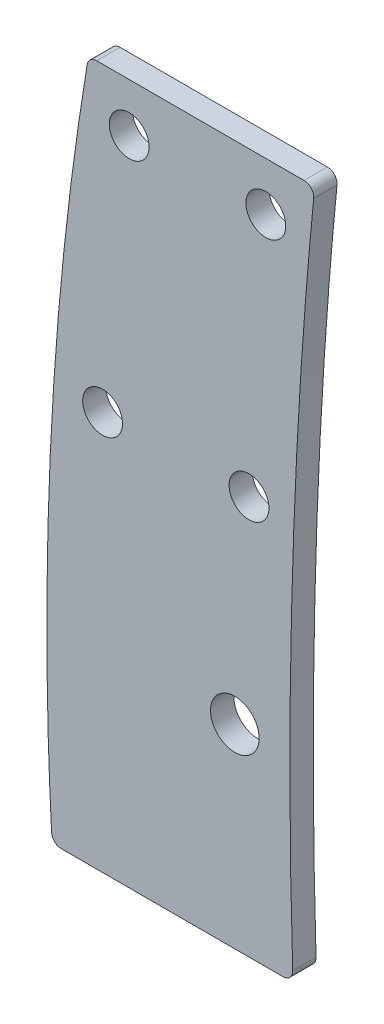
ISO-10303-21;
HEADER;
FILE_DESCRIPTION(('STEP AP214'),'2;1');
FILE_NAME('part.step','',(''),(''),'','','');
FILE_SCHEMA(('AUTOMOTIVE_DESIGN { 1 0 10303 214 1 1 1 1 }'));
ENDSEC;
DATA;
#1=APPLICATION_CONTEXT('core data for automotive mechanical design processes');
#2=APPLICATION_PROTOCOL_DEFINITION('international standard','automotive_design',2000,#1);
#3=PRODUCT_CONTEXT('',#1,'mechanical');
#4=PRODUCT('Part','Part','',(#3));
#5=PRODUCT_RELATED_PRODUCT_CATEGORY('part','',(#4));
#6=PRODUCT_DEFINITION_FORMATION('','',#4);
#7=PRODUCT_DEFINITION_CONTEXT('part definition',#1,'design');
#8=PRODUCT_DEFINITION('design','',#6,#7);
#9=PRODUCT_DEFINITION_SHAPE('','',#8);
#10=(LENGTH_UNIT() NAMED_UNIT(*) SI_UNIT(.MILLI.,.METRE.));
#11=(NAMED_UNIT(*) PLANE_ANGLE_UNIT() SI_UNIT($,.RADIAN.));
#12=(NAMED_UNIT(*) SI_UNIT($,.STERADIAN.) SOLID_ANGLE_UNIT());
#13=UNCERTAINTY_MEASURE_WITH_UNIT(LENGTH_MEASURE(1.E-05),#10,'distance_accuracy_value','');
#14=(GEOMETRIC_REPRESENTATION_CONTEXT(3) GLOBAL_UNCERTAINTY_ASSIGNED_CONTEXT((#13)) GLOBAL_UNIT_ASSIGNED_CONTEXT((#10,
#11,#12)) REPRESENTATION_CONTEXT('',''));
#15=CARTESIAN_POINT('',(0.,0.,0.));
#16=DIRECTION('',(0.,0.,1.));
#17=DIRECTION('',(1.,0.,0.));
#18=AXIS2_PLACEMENT_3D('',#15,#16,#17);
#19=CARTESIAN_POINT('',(-14.239497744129,-121.423692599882,2.3));
#20=DIRECTION('',(0.,0.,1.));
#21=DIRECTION('',(0.,1.,0.));
#22=AXIS2_PLACEMENT_3D('',#19,#20,#21);
#23=ELLIPSE('',#22,130.446604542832,50.);
#24=DIRECTION('',(0.,0.,-1.));
#25=VECTOR('',#24,1.);
#26=SURFACE_OF_LINEAR_EXTRUSION('',#23,#25);
#27=CARTESIAN_POINT('',(-14.239497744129,-121.423692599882,0.));
#28=DIRECTION('',(0.,0.,1.));
#29=DIRECTION('',(0.,1.,0.));
#30=AXIS2_PLACEMENT_3D('',#27,#28,#29);
#31=ELLIPSE('',#30,130.446604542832,50.);
#32=CARTESIAN_POINT('',(-60.089402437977,-69.3896398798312,0.));
#33=VERTEX_POINT('',#32);
#34=CARTESIAN_POINT('',(-63.7513035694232,-139.607983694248,0.));
#35=VERTEX_POINT('',#34);
#36=EDGE_CURVE('E104',#33,#35,#31,.T.);
#37=ORIENTED_EDGE('',*,*,#36,.T.);
#38=DIRECTION('',(0.,0.,-1.));
#39=VECTOR('',#38,1.);
#40=CARTESIAN_POINT('',(-63.7513035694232,-139.607983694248,0.));
#41=LINE('',#40,#39);
#42=CARTESIAN_POINT('',(-63.7513035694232,-139.607983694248,2.4));
#43=VERTEX_POINT('',#42);
#44=EDGE_CURVE('E99',#35,#43,#41,.F.);
#45=ORIENTED_EDGE('',*,*,#44,.T.);
#46=CARTESIAN_POINT('',(-14.239497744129,-121.423692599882,2.4));
#47=DIRECTION('',(0.,0.,1.));
#48=DIRECTION('',(0.,1.,0.));
#49=AXIS2_PLACEMENT_3D('',#46,#47,#48);
#50=ELLIPSE('',#49,130.446604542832,50.);
#51=CARTESIAN_POINT('',(-60.089402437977,-69.3896398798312,2.4));
#52=VERTEX_POINT('',#51);
#53=EDGE_CURVE('E102',#52,#43,#50,.T.);
#54=ORIENTED_EDGE('',*,*,#53,.F.);
#55=DIRECTION('',(0.,0.,-1.));
#56=VECTOR('',#55,1.);
#57=CARTESIAN_POINT('',(-60.089402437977,-69.3896398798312,2.3));
#58=LINE('',#57,#56);
#59=EDGE_CURVE('E108',#52,#33,#58,.T.);
#60=ORIENTED_EDGE('',*,*,#59,.T.);
#61=EDGE_LOOP('',(#37,#45,#54,#60));
#62=FACE_BOUND('',#61,.T.);
#63=ADVANCED_FACE('F33',(#62),#26,.F.);
#64=CARTESIAN_POINT('',(-14.239497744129,-121.423692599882,2.3));
#65=DIRECTION('',(0.,0.,-1.));
#66=DIRECTION('',(0.,-1.,0.));
#67=AXIS2_PLACEMENT_3D('',#64,#65,#66);
#68=ELLIPSE('',#67,120.,25.);
#69=DIRECTION('',(0.,0.,-1.));
#70=VECTOR('',#69,1.);
#71=SURFACE_OF_LINEAR_EXTRUSION('',#68,#70);
#72=DIRECTION('',(0.,0.,-1.));
#73=VECTOR('',#72,1.);
#74=CARTESIAN_POINT('',(-36.7932724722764,-69.6532402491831,0.));
#75=LINE('',#74,#73);
#76=CARTESIAN_POINT('',(-36.7932724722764,-69.6532402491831,0.));
#77=VERTEX_POINT('',#76);
#78=CARTESIAN_POINT('',(-36.7932724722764,-69.653240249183,2.4));
#79=VERTEX_POINT('',#78);
#80=EDGE_CURVE('E180',#77,#79,#75,.F.);
#81=ORIENTED_EDGE('',*,*,#80,.T.);
#82=CARTESIAN_POINT('',(-14.239497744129,-121.423692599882,2.4));
#83=DIRECTION('',(0.,0.,-1.));
#84=DIRECTION('',(0.,-1.,0.));
#85=AXIS2_PLACEMENT_3D('',#82,#83,#84);
#86=ELLIPSE('',#85,120.,25.);
#87=CARTESIAN_POINT('',(-38.9535210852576,-139.522334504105,2.4));
#88=VERTEX_POINT('',#87);
#89=EDGE_CURVE('E135',#88,#79,#86,.T.);
#90=ORIENTED_EDGE('',*,*,#89,.F.);
#91=DIRECTION('',(0.,0.,-1.));
#92=VECTOR('',#91,1.);
#93=CARTESIAN_POINT('',(-38.9535210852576,-139.522334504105,2.3));
#94=LINE('',#93,#92);
#95=CARTESIAN_POINT('',(-38.9535210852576,-139.522334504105,0.));
#96=VERTEX_POINT('',#95);
#97=EDGE_CURVE('E55',#88,#96,#94,.T.);
#98=ORIENTED_EDGE('',*,*,#97,.T.);
#99=CARTESIAN_POINT('',(-14.239497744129,-121.423692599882,0.));
#100=DIRECTION('',(0.,0.,-1.));
#101=DIRECTION('',(0.,-1.,0.));
#102=AXIS2_PLACEMENT_3D('',#99,#100,#101);
#103=ELLIPSE('',#102,120.,25.);
#104=EDGE_CURVE('E191',#96,#77,#103,.T.);
#105=ORIENTED_EDGE('',*,*,#104,.T.);
#106=EDGE_LOOP('',(#81,#90,#98,#105));
#107=FACE_BOUND('',#106,.T.);
#108=ADVANCED_FACE('F153',(#107),#71,.F.);
#109=CARTESIAN_POINT('',(-14.239497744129,-121.423692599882,0.));
#110=DIRECTION('',(0.,0.,1.));
#111=DIRECTION('',(1.,0.,0.));
#112=AXIS2_PLACEMENT_3D('',#109,#110,#111);
#113=PLANE('',#112);
#114=CARTESIAN_POINT('',(-55.7704318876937,-73.5541033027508,0.));
#115=DIRECTION('',(0.,0.,1.));
#116=DIRECTION('',(1.,0.,0.));
#117=AXIS2_PLACEMENT_3D('',#114,#115,#116);
#118=CIRCLE('',#117,2.04999999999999);
#119=CARTESIAN_POINT('',(-53.7204318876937,-73.5541033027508,0.));
#120=VERTEX_POINT('',#119);
#121=EDGE_CURVE('E225',#120,#120,#118,.T.);
#122=ORIENTED_EDGE('',*,*,#121,.T.);
#123=EDGE_LOOP('',(#122));
#124=FACE_BOUND('',#123,.T.);
#125=CARTESIAN_POINT('',(-41.7189587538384,-73.5541033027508,0.));
#126=DIRECTION('',(0.,0.,1.));
#127=DIRECTION('',(1.,0.,0.));
#128=AXIS2_PLACEMENT_3D('',#125,#126,#127);
#129=CIRCLE('',#128,2.04999999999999);
#130=CARTESIAN_POINT('',(-39.6689587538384,-73.5541033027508,0.));
#131=VERTEX_POINT('',#130);
#132=EDGE_CURVE('E229',#131,#131,#129,.T.);
#133=ORIENTED_EDGE('',*,*,#132,.T.);
#134=EDGE_LOOP('',(#133));
#135=FACE_BOUND('',#134,.T.);
#136=CARTESIAN_POINT('',(-43.4487055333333,-99.5541033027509,0.));
#137=DIRECTION('',(0.,0.,1.));
#138=DIRECTION('',(1.,0.,0.));
#139=AXIS2_PLACEMENT_3D('',#136,#137,#138);
#140=CIRCLE('',#139,2.04999999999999);
#141=CARTESIAN_POINT('',(-41.3987055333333,-99.5541033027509,0.));
#142=VERTEX_POINT('',#141);
#143=EDGE_CURVE('E233',#142,#142,#140,.T.);
#144=ORIENTED_EDGE('',*,*,#143,.T.);
#145=EDGE_LOOP('',(#144));
#146=FACE_BOUND('',#145,.T.);
#147=CARTESIAN_POINT('',(-58.5038553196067,-99.5541033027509,0.));
#148=DIRECTION('',(0.,0.,1.));
#149=DIRECTION('',(1.,0.,0.));
#150=AXIS2_PLACEMENT_3D('',#147,#148,#149);
#151=CIRCLE('',#150,2.04999999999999);
#152=CARTESIAN_POINT('',(-56.4538553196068,-99.5541033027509,0.));
#153=VERTEX_POINT('',#152);
#154=EDGE_CURVE('E237',#153,#153,#151,.T.);
#155=ORIENTED_EDGE('',*,*,#154,.T.);
#156=EDGE_LOOP('',(#155));
#157=FACE_BOUND('',#156,.T.);
#158=CARTESIAN_POINT('',(-44.9054314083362,-120.554103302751,0.));
#159=DIRECTION('',(0.,0.,1.));
#160=DIRECTION('',(1.,0.,0.));
#161=AXIS2_PLACEMENT_3D('',#158,#159,#160);
#162=CIRCLE('',#161,2.49999999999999);
#163=CARTESIAN_POINT('',(-42.4054314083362,-120.554103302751,0.));
#164=VERTEX_POINT('',#163);
#165=EDGE_CURVE('E124',#164,#164,#162,.T.);
#166=ORIENTED_EDGE('',*,*,#165,.T.);
#167=EDGE_LOOP('',(#166));
#168=FACE_BOUND('',#167,.T.);
#169=DIRECTION('',(1.,0.,0.));
#170=VECTOR('',#169,1.);
#171=CARTESIAN_POINT('',(-63.6988962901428,-140.554103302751,0.));
#172=LINE('',#171,#170);
#173=CARTESIAN_POINT('',(-62.7527561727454,-140.554103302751,0.));
#174=VERTEX_POINT('',#173);
#175=CARTESIAN_POINT('',(-39.9530163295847,-140.554103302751,0.));
#176=VERTEX_POINT('',#175);
#177=EDGE_CURVE('E188',#174,#176,#172,.T.);
#178=ORIENTED_EDGE('',*,*,#177,.F.);
#179=CARTESIAN_POINT('',(-62.7527561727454,-139.554103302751,0.));
#180=DIRECTION('',(0.,0.,1.));
#181=DIRECTION('',(1.,0.,0.));
#182=AXIS2_PLACEMENT_3D('',#179,#180,#181);
#183=CIRCLE('',#182,1.);
#184=EDGE_CURVE('E174',#174,#35,#183,.F.);
#185=ORIENTED_EDGE('',*,*,#184,.T.);
#186=ORIENTED_EDGE('',*,*,#36,.F.);
#187=CARTESIAN_POINT('',(-59.103019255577,-69.5541033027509,0.));
#188=DIRECTION('',(0.,0.,1.));
#189=DIRECTION('',(1.,0.,0.));
#190=AXIS2_PLACEMENT_3D('',#187,#188,#189);
#191=CIRCLE('',#190,1.);
#192=CARTESIAN_POINT('',(-59.103019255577,-68.5541033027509,0.));
#193=VERTEX_POINT('',#192);
#194=EDGE_CURVE('E170',#33,#193,#191,.F.);
#195=ORIENTED_EDGE('',*,*,#194,.T.);
#196=DIRECTION('',(-1.,0.,0.));
#197=VECTOR('',#196,1.);
#198=CARTESIAN_POINT('',(-36.6823326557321,-68.5541033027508,0.));
#199=LINE('',#198,#197);
#200=CARTESIAN_POINT('',(-37.7883462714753,-68.5541033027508,0.));
#201=VERTEX_POINT('',#200);
#202=EDGE_CURVE('E144',#201,#193,#199,.T.);
#203=ORIENTED_EDGE('',*,*,#202,.F.);
#204=CARTESIAN_POINT('',(-37.7883462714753,-69.5541033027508,0.));
#205=DIRECTION('',(0.,0.,1.));
#206=DIRECTION('',(1.,0.,0.));
#207=AXIS2_PLACEMENT_3D('',#204,#205,#206);
#208=CIRCLE('',#207,1.);
#209=EDGE_CURVE('E48',#201,#77,#208,.F.);
#210=ORIENTED_EDGE('',*,*,#209,.T.);
#211=ORIENTED_EDGE('',*,*,#104,.F.);
#212=CARTESIAN_POINT('',(-39.9530163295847,-139.554103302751,0.));
#213=DIRECTION('',(0.,0.,1.));
#214=DIRECTION('',(1.,0.,0.));
#215=AXIS2_PLACEMENT_3D('',#212,#213,#214);
#216=CIRCLE('',#215,1.);
#217=EDGE_CURVE('E172',#96,#176,#216,.F.);
#218=ORIENTED_EDGE('',*,*,#217,.T.);
#219=EDGE_LOOP('',(#178,#185,#186,#195,#203,#210,#211,#218));
#220=FACE_BOUND('',#219,.T.);
#221=ADVANCED_FACE('F187',(#124,#135,#146,#157,#168,#220),#113,.F.);
#222=CARTESIAN_POINT('',(-36.6823326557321,-68.5541033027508,0.));
#223=DIRECTION('',(0.,1.,0.));
#224=DIRECTION('',(-1.,0.,0.));
#225=AXIS2_PLACEMENT_3D('',#222,#223,#224);
#226=PLANE('',#225);
#227=ORIENTED_EDGE('',*,*,#202,.T.);
#228=DIRECTION('',(0.,0.,1.));
#229=VECTOR('',#228,1.);
#230=CARTESIAN_POINT('',(-59.103019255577,-68.5541033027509,2.3));
#231=LINE('',#230,#229);
#232=CARTESIAN_POINT('',(-59.103019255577,-68.5541033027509,2.4));
#233=VERTEX_POINT('',#232);
#234=EDGE_CURVE('E12',#193,#233,#231,.T.);
#235=ORIENTED_EDGE('',*,*,#234,.T.);
#236=DIRECTION('',(-1.,0.,0.));
#237=VECTOR('',#236,1.);
#238=CARTESIAN_POINT('',(-37.7883462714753,-68.5541033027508,2.4));
#239=LINE('',#238,#237);
#240=CARTESIAN_POINT('',(-37.7883462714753,-68.5541033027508,2.4));
#241=VERTEX_POINT('',#240);
#242=EDGE_CURVE('E141',#241,#233,#239,.T.);
#243=ORIENTED_EDGE('',*,*,#242,.F.);
#244=DIRECTION('',(0.,0.,1.));
#245=VECTOR('',#244,1.);
#246=CARTESIAN_POINT('',(-37.7883462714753,-68.5541033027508,0.));
#247=LINE('',#246,#245);
#248=EDGE_CURVE('E41',#241,#201,#247,.F.);
#249=ORIENTED_EDGE('',*,*,#248,.T.);
#250=EDGE_LOOP('',(#227,#235,#243,#249));
#251=FACE_BOUND('',#250,.T.);
#252=ADVANCED_FACE('F184',(#251),#226,.T.);
#253=CARTESIAN_POINT('',(-63.6988962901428,-140.554103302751,0.));
#254=DIRECTION('',(0.,-1.,0.));
#255=DIRECTION('',(1.,0.,0.));
#256=AXIS2_PLACEMENT_3D('',#253,#254,#255);
#257=PLANE('',#256);
#258=DIRECTION('',(0.,0.,1.));
#259=VECTOR('',#258,1.);
#260=CARTESIAN_POINT('',(-39.9530163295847,-140.554103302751,2.3));
#261=LINE('',#260,#259);
#262=CARTESIAN_POINT('',(-39.9530163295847,-140.554103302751,2.4));
#263=VERTEX_POINT('',#262);
#264=EDGE_CURVE('E107',#176,#263,#261,.T.);
#265=ORIENTED_EDGE('',*,*,#264,.T.);
#266=DIRECTION('',(1.,0.,0.));
#267=VECTOR('',#266,1.);
#268=CARTESIAN_POINT('',(-62.7527561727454,-140.554103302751,2.4));
#269=LINE('',#268,#267);
#270=CARTESIAN_POINT('',(-62.7527561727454,-140.554103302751,2.4));
#271=VERTEX_POINT('',#270);
#272=EDGE_CURVE('E117',#271,#263,#269,.T.);
#273=ORIENTED_EDGE('',*,*,#272,.F.);
#274=DIRECTION('',(0.,0.,1.));
#275=VECTOR('',#274,1.);
#276=CARTESIAN_POINT('',(-62.7527561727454,-140.554103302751,0.));
#277=LINE('',#276,#275);
#278=EDGE_CURVE('E113',#271,#174,#277,.F.);
#279=ORIENTED_EDGE('',*,*,#278,.T.);
#280=ORIENTED_EDGE('',*,*,#177,.T.);
#281=EDGE_LOOP('',(#265,#273,#279,#280));
#282=FACE_BOUND('',#281,.T.);
#283=ADVANCED_FACE('F158',(#282),#257,.T.);
#284=CARTESIAN_POINT('',(-62.7527561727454,-139.554103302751,1.15));
#285=DIRECTION('',(0.,0.,-1.));
#286=DIRECTION('',(-1.,0.,0.));
#287=AXIS2_PLACEMENT_3D('',#284,#285,#286);
#288=CYLINDRICAL_SURFACE('',#287,1.);
#289=ORIENTED_EDGE('',*,*,#184,.F.);
#290=ORIENTED_EDGE('',*,*,#278,.F.);
#291=CARTESIAN_POINT('',(-62.7527561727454,-139.554103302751,2.4));
#292=DIRECTION('',(0.,0.,1.));
#293=DIRECTION('',(1.,0.,0.));
#294=AXIS2_PLACEMENT_3D('',#291,#292,#293);
#295=CIRCLE('',#294,1.);
#296=EDGE_CURVE('E111',#43,#271,#295,.T.);
#297=ORIENTED_EDGE('',*,*,#296,.F.);
#298=ORIENTED_EDGE('',*,*,#44,.F.);
#299=EDGE_LOOP('',(#289,#290,#297,#298));
#300=FACE_BOUND('',#299,.T.);
#301=ADVANCED_FACE('F112',(#300),#288,.T.);
#302=CARTESIAN_POINT('',(-39.9530163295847,-139.554103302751,1.15));
#303=DIRECTION('',(0.,0.,-1.));
#304=DIRECTION('',(-1.,0.,0.));
#305=AXIS2_PLACEMENT_3D('',#302,#303,#304);
#306=CYLINDRICAL_SURFACE('',#305,1.);
#307=ORIENTED_EDGE('',*,*,#217,.F.);
#308=ORIENTED_EDGE('',*,*,#97,.F.);
#309=CARTESIAN_POINT('',(-39.9530163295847,-139.554103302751,2.4));
#310=DIRECTION('',(0.,0.,1.));
#311=DIRECTION('',(1.,0.,0.));
#312=AXIS2_PLACEMENT_3D('',#309,#310,#311);
#313=CIRCLE('',#312,1.);
#314=EDGE_CURVE('E132',#263,#88,#313,.T.);
#315=ORIENTED_EDGE('',*,*,#314,.F.);
#316=ORIENTED_EDGE('',*,*,#264,.F.);
#317=EDGE_LOOP('',(#307,#308,#315,#316));
#318=FACE_BOUND('',#317,.T.);
#319=ADVANCED_FACE('F157',(#318),#306,.T.);
#320=CARTESIAN_POINT('',(-59.103019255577,-69.5541033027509,1.15));
#321=DIRECTION('',(0.,0.,-1.));
#322=DIRECTION('',(-1.,0.,0.));
#323=AXIS2_PLACEMENT_3D('',#320,#321,#322);
#324=CYLINDRICAL_SURFACE('',#323,1.);
#325=ORIENTED_EDGE('',*,*,#194,.F.);
#326=ORIENTED_EDGE('',*,*,#59,.F.);
#327=CARTESIAN_POINT('',(-59.103019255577,-69.5541033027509,2.4));
#328=DIRECTION('',(0.,0.,1.));
#329=DIRECTION('',(1.,0.,0.));
#330=AXIS2_PLACEMENT_3D('',#327,#328,#329);
#331=CIRCLE('',#330,1.);
#332=EDGE_CURVE('E123',#233,#52,#331,.T.);
#333=ORIENTED_EDGE('',*,*,#332,.F.);
#334=ORIENTED_EDGE('',*,*,#234,.F.);
#335=EDGE_LOOP('',(#325,#326,#333,#334));
#336=FACE_BOUND('',#335,.T.);
#337=ADVANCED_FACE('F160',(#336),#324,.T.);
#338=CARTESIAN_POINT('',(-37.7883462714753,-69.5541033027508,1.15));
#339=DIRECTION('',(0.,0.,-1.));
#340=DIRECTION('',(-1.,0.,0.));
#341=AXIS2_PLACEMENT_3D('',#338,#339,#340);
#342=CYLINDRICAL_SURFACE('',#341,1.);
#343=ORIENTED_EDGE('',*,*,#209,.F.);
#344=ORIENTED_EDGE('',*,*,#248,.F.);
#345=CARTESIAN_POINT('',(-37.7883462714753,-69.5541033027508,2.4));
#346=DIRECTION('',(0.,0.,1.));
#347=DIRECTION('',(1.,0.,0.));
#348=AXIS2_PLACEMENT_3D('',#345,#346,#347);
#349=CIRCLE('',#348,1.);
#350=EDGE_CURVE('E138',#79,#241,#349,.T.);
#351=ORIENTED_EDGE('',*,*,#350,.F.);
#352=ORIENTED_EDGE('',*,*,#80,.F.);
#353=EDGE_LOOP('',(#343,#344,#351,#352));
#354=FACE_BOUND('',#353,.T.);
#355=ADVANCED_FACE('F35',(#354),#342,.T.);
#356=CARTESIAN_POINT('',(-14.239497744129,-121.423692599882,2.4));
#357=DIRECTION('',(0.,0.,1.));
#358=DIRECTION('',(1.,0.,0.));
#359=AXIS2_PLACEMENT_3D('',#356,#357,#358);
#360=PLANE('',#359);
#361=CARTESIAN_POINT('',(-55.7704318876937,-73.5541033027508,2.4));
#362=DIRECTION('',(0.,0.,1.));
#363=DIRECTION('',(1.,0.,0.));
#364=AXIS2_PLACEMENT_3D('',#361,#362,#363);
#365=CIRCLE('',#364,2.04999999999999);
#366=CARTESIAN_POINT('',(-53.7204318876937,-73.5541033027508,2.4));
#367=VERTEX_POINT('',#366);
#368=EDGE_CURVE('E269',#367,#367,#365,.T.);
#369=ORIENTED_EDGE('',*,*,#368,.F.);
#370=EDGE_LOOP('',(#369));
#371=FACE_BOUND('',#370,.T.);
#372=CARTESIAN_POINT('',(-41.7189587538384,-73.5541033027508,2.4));
#373=DIRECTION('',(0.,0.,1.));
#374=DIRECTION('',(1.,0.,0.));
#375=AXIS2_PLACEMENT_3D('',#372,#373,#374);
#376=CIRCLE('',#375,2.04999999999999);
#377=CARTESIAN_POINT('',(-39.6689587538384,-73.5541033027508,2.4));
#378=VERTEX_POINT('',#377);
#379=EDGE_CURVE('E270',#378,#378,#376,.T.);
#380=ORIENTED_EDGE('',*,*,#379,.F.);
#381=EDGE_LOOP('',(#380));
#382=FACE_BOUND('',#381,.T.);
#383=CARTESIAN_POINT('',(-43.4487055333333,-99.5541033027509,2.4));
#384=DIRECTION('',(0.,0.,1.));
#385=DIRECTION('',(1.,0.,0.));
#386=AXIS2_PLACEMENT_3D('',#383,#384,#385);
#387=CIRCLE('',#386,2.04999999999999);
#388=CARTESIAN_POINT('',(-41.3987055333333,-99.5541033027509,2.4));
#389=VERTEX_POINT('',#388);
#390=EDGE_CURVE('E277',#389,#389,#387,.T.);
#391=ORIENTED_EDGE('',*,*,#390,.F.);
#392=EDGE_LOOP('',(#391));
#393=FACE_BOUND('',#392,.T.);
#394=CARTESIAN_POINT('',(-58.5038553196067,-99.5541033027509,2.4));
#395=DIRECTION('',(0.,0.,1.));
#396=DIRECTION('',(1.,0.,0.));
#397=AXIS2_PLACEMENT_3D('',#394,#395,#396);
#398=CIRCLE('',#397,2.04999999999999);
#399=CARTESIAN_POINT('',(-56.4538553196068,-99.5541033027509,2.4));
#400=VERTEX_POINT('',#399);
#401=EDGE_CURVE('E281',#400,#400,#398,.T.);
#402=ORIENTED_EDGE('',*,*,#401,.F.);
#403=EDGE_LOOP('',(#402));
#404=FACE_BOUND('',#403,.T.);
#405=CARTESIAN_POINT('',(-44.9054314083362,-120.554103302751,2.4));
#406=DIRECTION('',(0.,0.,1.));
#407=DIRECTION('',(1.,0.,0.));
#408=AXIS2_PLACEMENT_3D('',#405,#406,#407);
#409=CIRCLE('',#408,2.5);
#410=CARTESIAN_POINT('',(-42.4054314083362,-120.554103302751,2.4));
#411=VERTEX_POINT('',#410);
#412=EDGE_CURVE('E127',#411,#411,#409,.T.);
#413=ORIENTED_EDGE('',*,*,#412,.F.);
#414=EDGE_LOOP('',(#413));
#415=FACE_BOUND('',#414,.T.);
#416=ORIENTED_EDGE('',*,*,#53,.T.);
#417=ORIENTED_EDGE('',*,*,#296,.T.);
#418=ORIENTED_EDGE('',*,*,#272,.T.);
#419=ORIENTED_EDGE('',*,*,#314,.T.);
#420=ORIENTED_EDGE('',*,*,#89,.T.);
#421=ORIENTED_EDGE('',*,*,#350,.T.);
#422=ORIENTED_EDGE('',*,*,#242,.T.);
#423=ORIENTED_EDGE('',*,*,#332,.T.);
#424=EDGE_LOOP('',(#416,#417,#418,#419,#420,#421,#422,#423));
#425=FACE_BOUND('',#424,.T.);
#426=ADVANCED_FACE('F120',(#371,#382,#393,#404,#415,#425),#360,.T.);
#427=CARTESIAN_POINT('',(-44.9054314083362,-120.554103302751,2.4));
#428=DIRECTION('',(0.,0.,1.));
#429=DIRECTION('',(1.,0.,0.));
#430=AXIS2_PLACEMENT_3D('',#427,#428,#429);
#431=CYLINDRICAL_SURFACE('',#430,2.49999999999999);
#432=ORIENTED_EDGE('',*,*,#412,.T.);
#433=EDGE_LOOP('',(#432));
#434=FACE_BOUND('',#433,.T.);
#435=ORIENTED_EDGE('',*,*,#165,.F.);
#436=EDGE_LOOP('',(#435));
#437=FACE_BOUND('',#436,.T.);
#438=ADVANCED_FACE('F240',(#434,#437),#431,.F.);
#439=CARTESIAN_POINT('',(-58.5038553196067,-99.5541033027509,2.4));
#440=DIRECTION('',(0.,0.,1.));
#441=DIRECTION('',(1.,0.,0.));
#442=AXIS2_PLACEMENT_3D('',#439,#440,#441);
#443=CYLINDRICAL_SURFACE('',#442,2.04999999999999);
#444=ORIENTED_EDGE('',*,*,#401,.T.);
#445=EDGE_LOOP('',(#444));
#446=FACE_BOUND('',#445,.T.);
#447=ORIENTED_EDGE('',*,*,#154,.F.);
#448=EDGE_LOOP('',(#447));
#449=FACE_BOUND('',#448,.T.);
#450=ADVANCED_FACE('F242',(#446,#449),#443,.F.);
#451=CARTESIAN_POINT('',(-43.4487055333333,-99.5541033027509,2.4));
#452=DIRECTION('',(0.,0.,1.));
#453=DIRECTION('',(1.,0.,0.));
#454=AXIS2_PLACEMENT_3D('',#451,#452,#453);
#455=CYLINDRICAL_SURFACE('',#454,2.04999999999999);
#456=ORIENTED_EDGE('',*,*,#390,.T.);
#457=EDGE_LOOP('',(#456));
#458=FACE_BOUND('',#457,.T.);
#459=ORIENTED_EDGE('',*,*,#143,.F.);
#460=EDGE_LOOP('',(#459));
#461=FACE_BOUND('',#460,.T.);
#462=ADVANCED_FACE('F248',(#458,#461),#455,.F.);
#463=CARTESIAN_POINT('',(-41.7189587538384,-73.5541033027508,2.4));
#464=DIRECTION('',(0.,0.,1.));
#465=DIRECTION('',(1.,0.,0.));
#466=AXIS2_PLACEMENT_3D('',#463,#464,#465);
#467=CYLINDRICAL_SURFACE('',#466,2.04999999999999);
#468=ORIENTED_EDGE('',*,*,#379,.T.);
#469=EDGE_LOOP('',(#468));
#470=FACE_BOUND('',#469,.T.);
#471=ORIENTED_EDGE('',*,*,#132,.F.);
#472=EDGE_LOOP('',(#471));
#473=FACE_BOUND('',#472,.T.);
#474=ADVANCED_FACE('F256',(#470,#473),#467,.F.);
#475=CARTESIAN_POINT('',(-55.7704318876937,-73.5541033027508,2.4));
#476=DIRECTION('',(0.,0.,1.));
#477=DIRECTION('',(1.,0.,0.));
#478=AXIS2_PLACEMENT_3D('',#475,#476,#477);
#479=CYLINDRICAL_SURFACE('',#478,2.04999999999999);
#480=ORIENTED_EDGE('',*,*,#368,.T.);
#481=EDGE_LOOP('',(#480));
#482=FACE_BOUND('',#481,.T.);
#483=ORIENTED_EDGE('',*,*,#121,.F.);
#484=EDGE_LOOP('',(#483));
#485=FACE_BOUND('',#484,.T.);
#486=ADVANCED_FACE('F260',(#482,#485),#479,.F.);
#487=CLOSED_SHELL('',(#63,#108,#221,#252,#283,#301,#319,#337,#355,#426,#438,#450,#462,#474,#486));
#488=MANIFOLD_SOLID_BREP('B2',#487);
#489=ADVANCED_BREP_SHAPE_REPRESENTATION('',(#18,#488),#14);
#490=SHAPE_DEFINITION_REPRESENTATION(#9,#489);
ENDSEC;
END-ISO-10303-21;
